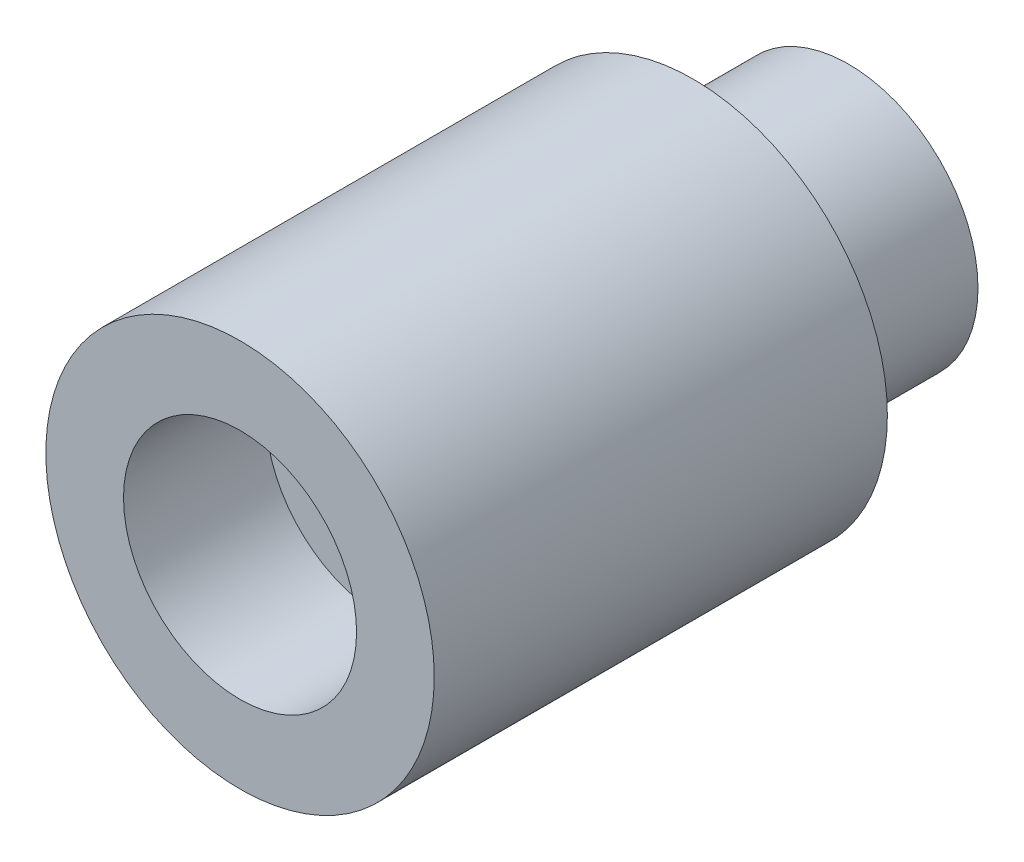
ISO-10303-21;
HEADER;
FILE_DESCRIPTION(('STEP AP214'),'2;1');
FILE_NAME('part.step','',(''),(''),'','','');
FILE_SCHEMA(('AUTOMOTIVE_DESIGN { 1 0 10303 214 1 1 1 1 }'));
ENDSEC;
DATA;
#1=APPLICATION_CONTEXT('core data for automotive mechanical design processes');
#2=APPLICATION_PROTOCOL_DEFINITION('international standard','automotive_design',2000,#1);
#3=PRODUCT_CONTEXT('',#1,'mechanical');
#4=PRODUCT('Part','Part','',(#3));
#5=PRODUCT_RELATED_PRODUCT_CATEGORY('part','',(#4));
#6=PRODUCT_DEFINITION_FORMATION('','',#4);
#7=PRODUCT_DEFINITION_CONTEXT('part definition',#1,'design');
#8=PRODUCT_DEFINITION('design','',#6,#7);
#9=PRODUCT_DEFINITION_SHAPE('','',#8);
#10=(LENGTH_UNIT() NAMED_UNIT(*) SI_UNIT(.MILLI.,.METRE.));
#11=(NAMED_UNIT(*) PLANE_ANGLE_UNIT() SI_UNIT($,.RADIAN.));
#12=(NAMED_UNIT(*) SI_UNIT($,.STERADIAN.) SOLID_ANGLE_UNIT());
#13=UNCERTAINTY_MEASURE_WITH_UNIT(LENGTH_MEASURE(1.E-05),#10,'distance_accuracy_value','');
#14=(GEOMETRIC_REPRESENTATION_CONTEXT(3) GLOBAL_UNCERTAINTY_ASSIGNED_CONTEXT((#13)) GLOBAL_UNIT_ASSIGNED_CONTEXT((#10,
#11,#12)) REPRESENTATION_CONTEXT('',''));
#15=CARTESIAN_POINT('',(0.,0.,0.));
#16=DIRECTION('',(0.,0.,1.));
#17=DIRECTION('',(1.,0.,0.));
#18=AXIS2_PLACEMENT_3D('',#15,#16,#17);
#19=CARTESIAN_POINT('',(15.,0.,35.));
#20=DIRECTION('',(0.,0.,-1.));
#21=DIRECTION('',(-1.,0.,0.));
#22=AXIS2_PLACEMENT_3D('',#19,#20,#21);
#23=PLANE('',#22);
#24=CARTESIAN_POINT('',(0.,0.,35.));
#25=DIRECTION('',(0.,0.,1.));
#26=DIRECTION('',(1.,0.,0.));
#27=AXIS2_PLACEMENT_3D('',#24,#25,#26);
#28=CIRCLE('',#27,9.);
#29=CARTESIAN_POINT('',(9.,0.,35.));
#30=VERTEX_POINT('',#29);
#31=EDGE_CURVE('E8',#30,#30,#28,.T.);
#32=ORIENTED_EDGE('',*,*,#31,.F.);
#33=EDGE_LOOP('',(#32));
#34=FACE_BOUND('',#33,.T.);
#35=CARTESIAN_POINT('',(0.,0.,35.));
#36=DIRECTION('',(0.,0.,1.));
#37=DIRECTION('',(1.,0.,0.));
#38=AXIS2_PLACEMENT_3D('',#35,#36,#37);
#39=CIRCLE('',#38,15.);
#40=CARTESIAN_POINT('',(15.,0.,35.));
#41=VERTEX_POINT('',#40);
#42=EDGE_CURVE('E40',#41,#41,#39,.T.);
#43=ORIENTED_EDGE('',*,*,#42,.T.);
#44=EDGE_LOOP('',(#43));
#45=FACE_BOUND('',#44,.T.);
#46=ADVANCED_FACE('F12',(#34,#45),#23,.F.);
#47=CARTESIAN_POINT('',(0.,0.,18.));
#48=DIRECTION('',(0.,0.,1.));
#49=DIRECTION('',(1.,0.,0.));
#50=AXIS2_PLACEMENT_3D('',#47,#48,#49);
#51=CYLINDRICAL_SURFACE('',#50,9.);
#52=CARTESIAN_POINT('',(0.,0.,24.));
#53=DIRECTION('',(0.,0.,1.));
#54=DIRECTION('',(1.,0.,0.));
#55=AXIS2_PLACEMENT_3D('',#52,#53,#54);
#56=CIRCLE('',#55,9.);
#57=CARTESIAN_POINT('',(9.,0.,24.));
#58=VERTEX_POINT('',#57);
#59=EDGE_CURVE('E18',#58,#58,#56,.T.);
#60=ORIENTED_EDGE('',*,*,#59,.F.);
#61=EDGE_LOOP('',(#60));
#62=FACE_BOUND('',#61,.T.);
#63=ORIENTED_EDGE('',*,*,#31,.T.);
#64=EDGE_LOOP('',(#63));
#65=FACE_BOUND('',#64,.T.);
#66=ADVANCED_FACE('F77',(#62,#65),#51,.F.);
#67=CARTESIAN_POINT('',(9.,0.,24.));
#68=DIRECTION('',(0.,0.,-1.));
#69=DIRECTION('',(-1.,0.,0.));
#70=AXIS2_PLACEMENT_3D('',#67,#68,#69);
#71=PLANE('',#70);
#72=CARTESIAN_POINT('',(0.,0.,24.));
#73=DIRECTION('',(0.,0.,1.));
#74=DIRECTION('',(1.,0.,0.));
#75=AXIS2_PLACEMENT_3D('',#72,#73,#74);
#76=CIRCLE('',#75,5.5);
#77=CARTESIAN_POINT('',(5.5,0.,24.));
#78=VERTEX_POINT('',#77);
#79=EDGE_CURVE('E22',#78,#78,#76,.T.);
#80=ORIENTED_EDGE('',*,*,#79,.F.);
#81=EDGE_LOOP('',(#80));
#82=FACE_BOUND('',#81,.T.);
#83=ORIENTED_EDGE('',*,*,#59,.T.);
#84=EDGE_LOOP('',(#83));
#85=FACE_BOUND('',#84,.T.);
#86=ADVANCED_FACE('F72',(#82,#85),#71,.F.);
#87=CARTESIAN_POINT('',(0.,0.,18.));
#88=DIRECTION('',(0.,0.,1.));
#89=DIRECTION('',(1.,0.,0.));
#90=AXIS2_PLACEMENT_3D('',#87,#88,#89);
#91=CYLINDRICAL_SURFACE('',#90,5.5);
#92=CARTESIAN_POINT('',(0.,0.,-12.));
#93=DIRECTION('',(0.,0.,1.));
#94=DIRECTION('',(1.,0.,0.));
#95=AXIS2_PLACEMENT_3D('',#92,#93,#94);
#96=CIRCLE('',#95,5.5);
#97=CARTESIAN_POINT('',(5.5,0.,-12.));
#98=VERTEX_POINT('',#97);
#99=EDGE_CURVE('E26',#98,#98,#96,.T.);
#100=ORIENTED_EDGE('',*,*,#99,.F.);
#101=EDGE_LOOP('',(#100));
#102=FACE_BOUND('',#101,.T.);
#103=ORIENTED_EDGE('',*,*,#79,.T.);
#104=EDGE_LOOP('',(#103));
#105=FACE_BOUND('',#104,.T.);
#106=ADVANCED_FACE('F66',(#102,#105),#91,.F.);
#107=CARTESIAN_POINT('',(5.5,0.,-12.));
#108=DIRECTION('',(0.,0.,1.));
#109=DIRECTION('',(1.,0.,0.));
#110=AXIS2_PLACEMENT_3D('',#107,#108,#109);
#111=PLANE('',#110);
#112=CARTESIAN_POINT('',(0.,0.,-12.));
#113=DIRECTION('',(0.,0.,1.));
#114=DIRECTION('',(1.,0.,0.));
#115=AXIS2_PLACEMENT_3D('',#112,#113,#114);
#116=CIRCLE('',#115,10.);
#117=CARTESIAN_POINT('',(10.,0.,-12.));
#118=VERTEX_POINT('',#117);
#119=EDGE_CURVE('E31',#118,#118,#116,.T.);
#120=ORIENTED_EDGE('',*,*,#119,.F.);
#121=EDGE_LOOP('',(#120));
#122=FACE_BOUND('',#121,.T.);
#123=ORIENTED_EDGE('',*,*,#99,.T.);
#124=EDGE_LOOP('',(#123));
#125=FACE_BOUND('',#124,.T.);
#126=ADVANCED_FACE('F60',(#122,#125),#111,.F.);
#127=CARTESIAN_POINT('',(0.,0.,18.));
#128=DIRECTION('',(0.,0.,1.));
#129=DIRECTION('',(1.,0.,0.));
#130=AXIS2_PLACEMENT_3D('',#127,#128,#129);
#131=CYLINDRICAL_SURFACE('',#130,10.);
#132=CARTESIAN_POINT('',(0.,0.,0.));
#133=DIRECTION('',(0.,0.,1.));
#134=DIRECTION('',(1.,0.,0.));
#135=AXIS2_PLACEMENT_3D('',#132,#133,#134);
#136=CIRCLE('',#135,10.);
#137=CARTESIAN_POINT('',(10.,0.,0.));
#138=VERTEX_POINT('',#137);
#139=EDGE_CURVE('E34',#138,#138,#136,.T.);
#140=ORIENTED_EDGE('',*,*,#139,.F.);
#141=EDGE_LOOP('',(#140));
#142=FACE_BOUND('',#141,.T.);
#143=ORIENTED_EDGE('',*,*,#119,.T.);
#144=EDGE_LOOP('',(#143));
#145=FACE_BOUND('',#144,.T.);
#146=ADVANCED_FACE('F54',(#142,#145),#131,.T.);
#147=CARTESIAN_POINT('',(10.,0.,0.));
#148=DIRECTION('',(0.,0.,1.));
#149=DIRECTION('',(1.,0.,0.));
#150=AXIS2_PLACEMENT_3D('',#147,#148,#149);
#151=PLANE('',#150);
#152=CARTESIAN_POINT('',(0.,0.,0.));
#153=DIRECTION('',(0.,0.,1.));
#154=DIRECTION('',(1.,0.,0.));
#155=AXIS2_PLACEMENT_3D('',#152,#153,#154);
#156=CIRCLE('',#155,15.);
#157=CARTESIAN_POINT('',(15.,0.,0.));
#158=VERTEX_POINT('',#157);
#159=EDGE_CURVE('E37',#158,#158,#156,.T.);
#160=ORIENTED_EDGE('',*,*,#159,.F.);
#161=EDGE_LOOP('',(#160));
#162=FACE_BOUND('',#161,.T.);
#163=ORIENTED_EDGE('',*,*,#139,.T.);
#164=EDGE_LOOP('',(#163));
#165=FACE_BOUND('',#164,.T.);
#166=ADVANCED_FACE('F48',(#162,#165),#151,.F.);
#167=CARTESIAN_POINT('',(0.,0.,18.));
#168=DIRECTION('',(0.,0.,1.));
#169=DIRECTION('',(1.,0.,0.));
#170=AXIS2_PLACEMENT_3D('',#167,#168,#169);
#171=CYLINDRICAL_SURFACE('',#170,15.);
#172=ORIENTED_EDGE('',*,*,#42,.F.);
#173=EDGE_LOOP('',(#172));
#174=FACE_BOUND('',#173,.T.);
#175=ORIENTED_EDGE('',*,*,#159,.T.);
#176=EDGE_LOOP('',(#175));
#177=FACE_BOUND('',#176,.T.);
#178=ADVANCED_FACE('F45',(#174,#177),#171,.T.);
#179=CLOSED_SHELL('',(#46,#66,#86,#106,#126,#146,#166,#178));
#180=MANIFOLD_SOLID_BREP('B1',#179);
#181=ADVANCED_BREP_SHAPE_REPRESENTATION('',(#18,#180),#14);
#182=SHAPE_DEFINITION_REPRESENTATION(#9,#181);
ENDSEC;
END-ISO-10303-21;
